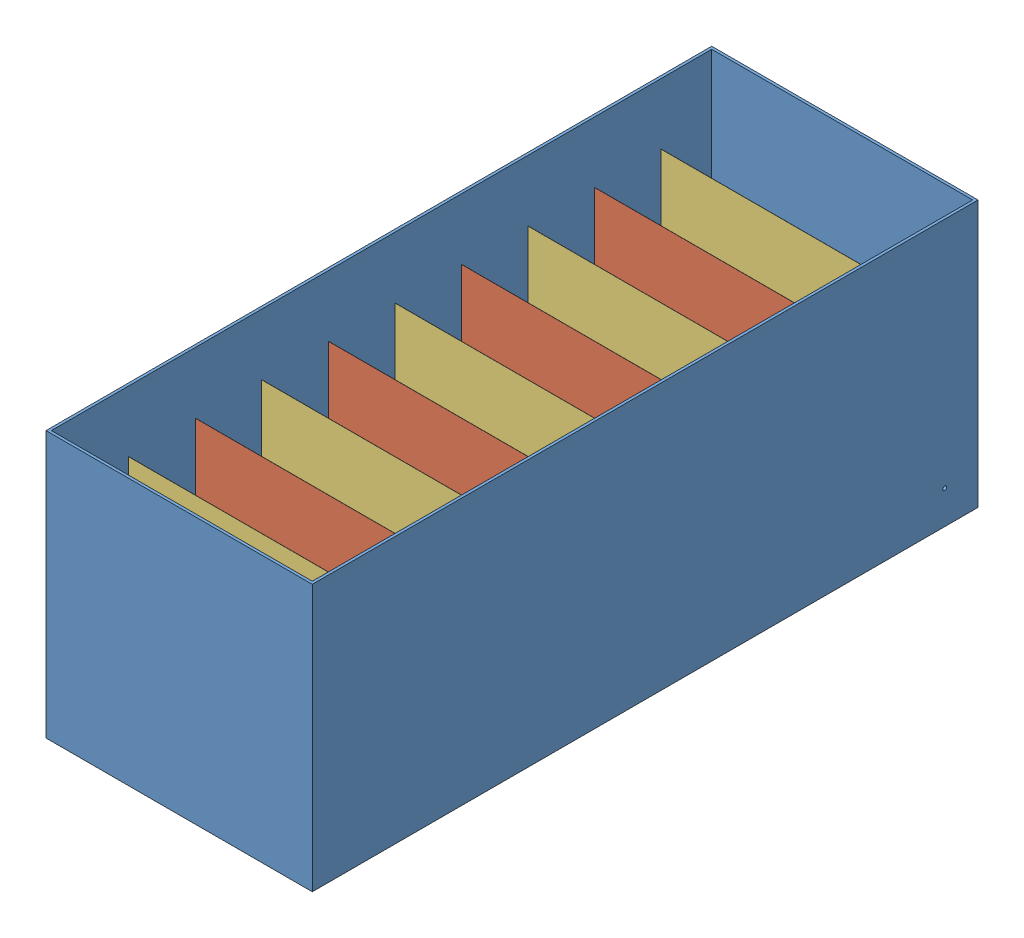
SolidWorks assembly Ensamblaje1.sldasm, configuration Predeterminado (file format 14000). Lengths in mm.
Overall size (200 200 500).
10 component instances, 3 part files, 6 mates.
Components (placement in the parent):
- Cubo-1: Cubo.SLDPRT [Predeterminado] at (153.0982 80.3065 478.2288) size (200 200 500)
- Lamina Platino-1: Lamina Platino.SLDPRT [Predeterminado] at (153.0982 162.3065 626.0288) size (180 160 0.1)
- Lamina Carbon-1: Lamina Carbon.SLDPRT [Predeterminado] at (153.0982 162.3065 676.1288) size (180 160 0.1)
- Lamina Carbon-2: Lamina Carbon.SLDPRT [Predeterminado] at (153.0982 162.3065 576.1288) size (180 160 0.1)
- Lamina Carbon-3: Lamina Carbon.SLDPRT [Predeterminado] at (153.0982 162.3065 476.1288) size (180 160 0.1)
- Lamina Carbon-4: Lamina Carbon.SLDPRT [Predeterminado] at (153.0982 162.3065 376.1288) size (180 160 0.1)
- Lamina Carbon-5: Lamina Carbon.SLDPRT [Predeterminado] at (153.0982 162.3065 276.1288) size (180 160 0.1)
- Lamina Platino-2: Lamina Platino.SLDPRT [Predeterminado] at (153.0982 162.3065 526.0288) size (180 160 0.1)
- Lamina Platino-3: Lamina Platino.SLDPRT [Predeterminado] at (153.0982 162.3065 426.0288) size (180 160 0.1)
- Lamina Platino-4: Lamina Platino.SLDPRT [Predeterminado] at (153.0982 162.3065 326.0288) size (180 160 0.1)
Mates (geometry in assembly coordinates):
- Ancho1: width anti-aligned: plane of Cubo-1 through (251.0982 280.3065 728.2288) normal (-1 0 0); plane of Lamina Carbon-1 through (55.0982 280.3065 728.2288) normal (1 0 0); plane of Cubo-1 through (243.0982 82.3065 676.2288) normal (1 0 0); plane of Lamina Carbon-1 through (63.0982 82.3065 676.2288) normal (-1 0 0)
- Coincidente2: coincident anti-aligned: plane of Cubo-1 through (153.0982 82.3065 478.2288) normal (0 1 0); plane of Lamina Carbon-1 through (63.0982 82.3065 676.2288) normal (0 -1 0)
- Distancia2: distance = 50 mm anti-aligned: plane of Lamina Carbon-1 through (153.0982 162.3065 676.2288) normal (0 0 1); plane of Cubo-1 through (53.0982 280.3065 726.2288) normal (0 0 -1)
- Ancho2: width anti-aligned: plane of Cubo-1 through (55.0982 280.3065 728.2288) normal (1 0 0); plane of Lamina Platino-1 through (251.0982 280.3065 728.2288) normal (-1 0 0); plane of Cubo-1 through (63.0982 82.3065 626.1288) normal (-1 0 0); plane of Lamina Platino-1 through (243.0982 82.3065 626.1288) normal (1 0 0)
- Coincidente4: coincident anti-aligned: plane of Cubo-1 through (153.0982 82.3065 478.2288) normal (0 1 0); plane of Lamina Platino-1 through (63.0982 82.3065 626.1288) normal (0 -1 0)
- Distancia4: distance = 50 mm anti-aligned: plane of Lamina Platino-1 through (153.0982 162.3065 626.1288) normal (0 0 1); plane of Lamina Carbon-1 through (153.0982 162.3065 676.1288) normal (0 0 -1)
